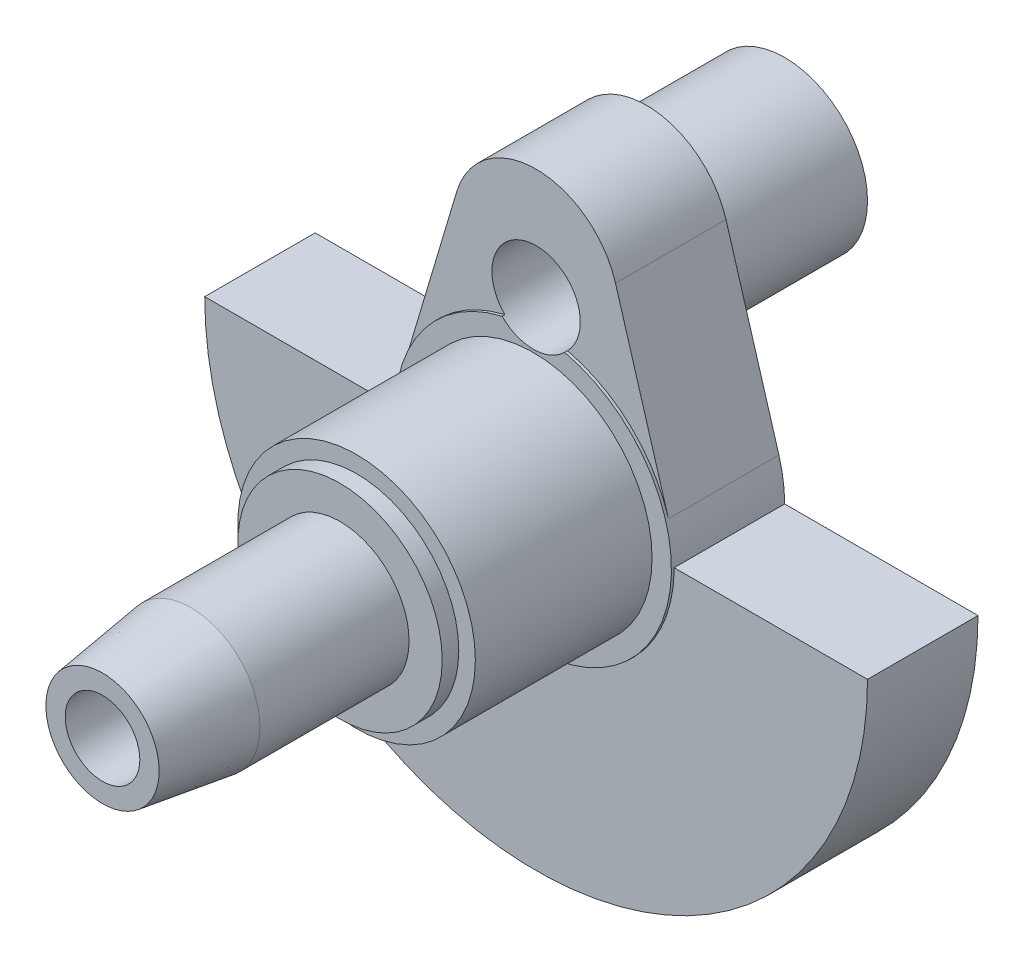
ISO-10303-21;
HEADER;
FILE_DESCRIPTION(('STEP AP214'),'2;1');
FILE_NAME('part.step','',(''),(''),'','','');
FILE_SCHEMA(('AUTOMOTIVE_DESIGN { 1 0 10303 214 1 1 1 1 }'));
ENDSEC;
DATA;
#1=APPLICATION_CONTEXT('core data for automotive mechanical design processes');
#2=APPLICATION_PROTOCOL_DEFINITION('international standard','automotive_design',2000,#1);
#3=PRODUCT_CONTEXT('',#1,'mechanical');
#4=PRODUCT('Part','Part','',(#3));
#5=PRODUCT_RELATED_PRODUCT_CATEGORY('part','',(#4));
#6=PRODUCT_DEFINITION_FORMATION('','',#4);
#7=PRODUCT_DEFINITION_CONTEXT('part definition',#1,'design');
#8=PRODUCT_DEFINITION('design','',#6,#7);
#9=PRODUCT_DEFINITION_SHAPE('','',#8);
#10=(LENGTH_UNIT() NAMED_UNIT(*) SI_UNIT(.MILLI.,.METRE.));
#11=(NAMED_UNIT(*) PLANE_ANGLE_UNIT() SI_UNIT($,.RADIAN.));
#12=(NAMED_UNIT(*) SI_UNIT($,.STERADIAN.) SOLID_ANGLE_UNIT());
#13=UNCERTAINTY_MEASURE_WITH_UNIT(LENGTH_MEASURE(1.E-05),#10,'distance_accuracy_value','');
#14=(GEOMETRIC_REPRESENTATION_CONTEXT(3) GLOBAL_UNCERTAINTY_ASSIGNED_CONTEXT((#13)) GLOBAL_UNIT_ASSIGNED_CONTEXT((#10,
#11,#12)) REPRESENTATION_CONTEXT('',''));
#15=CARTESIAN_POINT('',(0.,0.,0.));
#16=DIRECTION('',(0.,0.,1.));
#17=DIRECTION('',(1.,0.,0.));
#18=AXIS2_PLACEMENT_3D('',#15,#16,#17);
#19=CARTESIAN_POINT('',(0.,0.,-40.));
#20=DIRECTION('',(0.,0.,1.));
#21=DIRECTION('',(1.,0.,0.));
#22=AXIS2_PLACEMENT_3D('',#19,#20,#21);
#23=PLANE('',#22);
#24=CARTESIAN_POINT('',(0.,0.,-40.));
#25=DIRECTION('',(0.,0.,1.));
#26=DIRECTION('',(1.,0.,0.));
#27=AXIS2_PLACEMENT_3D('',#24,#25,#26);
#28=CIRCLE('',#27,50.);
#29=CARTESIAN_POINT('',(50.,0.,-40.));
#30=VERTEX_POINT('',#29);
#31=CARTESIAN_POINT('',(47.9157423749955,14.2857142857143,-40.));
#32=VERTEX_POINT('',#31);
#33=EDGE_CURVE('E129',#30,#32,#28,.T.);
#34=ORIENTED_EDGE('',*,*,#33,.F.);
#35=DIRECTION('',(1.,0.,0.));
#36=VECTOR('',#35,1.);
#37=CARTESIAN_POINT('',(0.,0.,-40.));
#38=LINE('',#37,#36);
#39=CARTESIAN_POINT('',(120.,0.,-40.));
#40=VERTEX_POINT('',#39);
#41=EDGE_CURVE('E127',#30,#40,#38,.T.);
#42=ORIENTED_EDGE('',*,*,#41,.T.);
#43=CARTESIAN_POINT('',(0.,0.,-40.));
#44=DIRECTION('',(0.,0.,1.));
#45=DIRECTION('',(1.,0.,0.));
#46=AXIS2_PLACEMENT_3D('',#43,#44,#45);
#47=CIRCLE('',#46,120.);
#48=CARTESIAN_POINT('',(-120.,0.,-40.));
#49=VERTEX_POINT('',#48);
#50=EDGE_CURVE('E131',#49,#40,#47,.T.);
#51=ORIENTED_EDGE('',*,*,#50,.F.);
#52=DIRECTION('',(-1.,0.,0.));
#53=VECTOR('',#52,1.);
#54=CARTESIAN_POINT('',(0.,0.,-40.));
#55=LINE('',#54,#53);
#56=CARTESIAN_POINT('',(-50.,0.,-40.));
#57=VERTEX_POINT('',#56);
#58=EDGE_CURVE('E305',#57,#49,#55,.T.);
#59=ORIENTED_EDGE('',*,*,#58,.F.);
#60=CARTESIAN_POINT('',(-47.9157423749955,14.2857142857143,-40.));
#61=VERTEX_POINT('',#60);
#62=EDGE_CURVE('E126',#61,#57,#28,.T.);
#63=ORIENTED_EDGE('',*,*,#62,.F.);
#64=DIRECTION('',(0.285714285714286,0.95831484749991,0.));
#65=VECTOR('',#64,1.);
#66=CARTESIAN_POINT('',(-47.9157423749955,14.2857142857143,-40.));
#67=LINE('',#66,#65);
#68=CARTESIAN_POINT('',(-28.7494454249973,78.5714285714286,-40.));
#69=VERTEX_POINT('',#68);
#70=EDGE_CURVE('E286',#61,#69,#67,.T.);
#71=ORIENTED_EDGE('',*,*,#70,.T.);
#72=CARTESIAN_POINT('',(0.,70.,-40.));
#73=DIRECTION('',(0.,0.,1.));
#74=DIRECTION('',(1.,0.,0.));
#75=AXIS2_PLACEMENT_3D('',#72,#73,#74);
#76=CIRCLE('',#75,30.);
#77=CARTESIAN_POINT('',(28.7494454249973,78.5714285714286,-40.));
#78=VERTEX_POINT('',#77);
#79=EDGE_CURVE('E282',#78,#69,#76,.T.);
#80=ORIENTED_EDGE('',*,*,#79,.F.);
#81=DIRECTION('',(-0.285714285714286,0.95831484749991,0.));
#82=VECTOR('',#81,1.);
#83=CARTESIAN_POINT('',(47.9157423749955,14.2857142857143,-40.));
#84=LINE('',#83,#82);
#85=EDGE_CURVE('E279',#32,#78,#84,.T.);
#86=ORIENTED_EDGE('',*,*,#85,.F.);
#87=EDGE_LOOP('',(#34,#42,#51,#59,#63,#71,#80,#86));
#88=FACE_BOUND('',#87,.T.);
#89=CARTESIAN_POINT('',(0.,60.,-40.));
#90=DIRECTION('',(0.,0.,1.));
#91=DIRECTION('',(1.,0.,0.));
#92=AXIS2_PLACEMENT_3D('',#89,#90,#91);
#93=CIRCLE('',#92,30.);
#94=CARTESIAN_POINT('',(30.,60.,-40.));
#95=VERTEX_POINT('',#94);
#96=EDGE_CURVE('E42',#95,#95,#93,.F.);
#97=ORIENTED_EDGE('',*,*,#96,.F.);
#98=EDGE_LOOP('',(#97));
#99=FACE_BOUND('',#98,.T.);
#100=ADVANCED_FACE('F34',(#88,#99),#23,.F.);
#101=CARTESIAN_POINT('',(0.,0.,1.));
#102=DIRECTION('',(0.,0.,1.));
#103=DIRECTION('',(1.,0.,0.));
#104=AXIS2_PLACEMENT_3D('',#101,#102,#103);
#105=PLANE('',#104);
#106=CARTESIAN_POINT('',(0.,60.,1.));
#107=DIRECTION('',(0.,0.,1.));
#108=DIRECTION('',(1.,0.,0.));
#109=AXIS2_PLACEMENT_3D('',#106,#107,#108);
#110=CIRCLE('',#109,16.);
#111=CARTESIAN_POINT('',(11.3274004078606,48.7,1.));
#112=VERTEX_POINT('',#111);
#113=CARTESIAN_POINT('',(-11.3274004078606,48.7,1.));
#114=VERTEX_POINT('',#113);
#115=EDGE_CURVE('E109',#112,#114,#110,.F.);
#116=ORIENTED_EDGE('',*,*,#115,.T.);
#117=CARTESIAN_POINT('',(0.,0.,1.));
#118=DIRECTION('',(0.,0.,1.));
#119=DIRECTION('',(1.,0.,0.));
#120=AXIS2_PLACEMENT_3D('',#117,#118,#119);
#121=CIRCLE('',#120,50.);
#122=EDGE_CURVE('E120',#114,#112,#121,.T.);
#123=ORIENTED_EDGE('',*,*,#122,.T.);
#124=EDGE_LOOP('',(#116,#123));
#125=FACE_BOUND('',#124,.T.);
#126=CARTESIAN_POINT('',(0.,0.,1.00000000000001));
#127=DIRECTION('',(0.,0.,1.));
#128=DIRECTION('',(1.,0.,0.));
#129=AXIS2_PLACEMENT_3D('',#126,#127,#128);
#130=CIRCLE('',#129,43.);
#131=CARTESIAN_POINT('',(43.,0.,1.00000000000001));
#132=VERTEX_POINT('',#131);
#133=EDGE_CURVE('E275',#132,#132,#130,.T.);
#134=ORIENTED_EDGE('',*,*,#133,.F.);
#135=EDGE_LOOP('',(#134));
#136=FACE_BOUND('',#135,.T.);
#137=ADVANCED_FACE('F124',(#125,#136),#105,.T.);
#138=CARTESIAN_POINT('',(0.,0.,-40.));
#139=DIRECTION('',(0.,0.,1.));
#140=DIRECTION('',(1.,0.,0.));
#141=AXIS2_PLACEMENT_3D('',#138,#139,#140);
#142=CYLINDRICAL_SURFACE('',#141,50.);
#143=DIRECTION('',(0.,0.,-1.));
#144=VECTOR('',#143,1.);
#145=CARTESIAN_POINT('',(-11.3274004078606,48.7,-19.5));
#146=LINE('',#145,#144);
#147=CARTESIAN_POINT('',(-11.3274004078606,48.7,0.));
#148=VERTEX_POINT('',#147);
#149=EDGE_CURVE('E113',#148,#114,#146,.F.);
#150=ORIENTED_EDGE('',*,*,#149,.F.);
#151=CARTESIAN_POINT('',(0.,0.,0.));
#152=DIRECTION('',(0.,0.,1.));
#153=DIRECTION('',(1.,0.,0.));
#154=AXIS2_PLACEMENT_3D('',#151,#152,#153);
#155=CIRCLE('',#154,50.);
#156=CARTESIAN_POINT('',(-47.9157423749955,14.2857142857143,0.));
#157=VERTEX_POINT('',#156);
#158=EDGE_CURVE('E292',#148,#157,#155,.T.);
#159=ORIENTED_EDGE('',*,*,#158,.T.);
#160=DIRECTION('',(0.,0.,1.));
#161=VECTOR('',#160,1.);
#162=CARTESIAN_POINT('',(-47.9157423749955,14.2857142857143,-308.328157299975));
#163=LINE('',#162,#161);
#164=EDGE_CURVE('E299',#61,#157,#163,.T.);
#165=ORIENTED_EDGE('',*,*,#164,.F.);
#166=ORIENTED_EDGE('',*,*,#62,.T.);
#167=DIRECTION('',(0.,0.,1.));
#168=VECTOR('',#167,1.);
#169=CARTESIAN_POINT('',(-50.,0.,-308.328157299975));
#170=LINE('',#169,#168);
#171=CARTESIAN_POINT('',(-50.,0.,0.));
#172=VERTEX_POINT('',#171);
#173=EDGE_CURVE('E323',#57,#172,#170,.T.);
#174=ORIENTED_EDGE('',*,*,#173,.T.);
#175=CARTESIAN_POINT('',(0.,0.,0.));
#176=DIRECTION('',(0.,0.,1.));
#177=DIRECTION('',(1.,0.,0.));
#178=AXIS2_PLACEMENT_3D('',#175,#176,#177);
#179=CIRCLE('',#178,50.);
#180=CARTESIAN_POINT('',(50.,0.,0.));
#181=VERTEX_POINT('',#180);
#182=EDGE_CURVE('E316',#172,#181,#179,.T.);
#183=ORIENTED_EDGE('',*,*,#182,.T.);
#184=DIRECTION('',(0.,0.,1.));
#185=VECTOR('',#184,1.);
#186=CARTESIAN_POINT('',(50.,0.,-308.328157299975));
#187=LINE('',#186,#185);
#188=EDGE_CURVE('E325',#30,#181,#187,.T.);
#189=ORIENTED_EDGE('',*,*,#188,.F.);
#190=ORIENTED_EDGE('',*,*,#33,.T.);
#191=DIRECTION('',(0.,0.,1.));
#192=VECTOR('',#191,1.);
#193=CARTESIAN_POINT('',(47.9157423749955,14.2857142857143,-308.328157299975));
#194=LINE('',#193,#192);
#195=CARTESIAN_POINT('',(47.9157423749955,14.2857142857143,0.));
#196=VERTEX_POINT('',#195);
#197=EDGE_CURVE('E56',#32,#196,#194,.T.);
#198=ORIENTED_EDGE('',*,*,#197,.T.);
#199=CARTESIAN_POINT('',(11.3274004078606,48.7,0.));
#200=VERTEX_POINT('',#199);
#201=EDGE_CURVE('E122',#196,#200,#155,.T.);
#202=ORIENTED_EDGE('',*,*,#201,.T.);
#203=DIRECTION('',(0.,0.,-1.));
#204=VECTOR('',#203,1.);
#205=CARTESIAN_POINT('',(11.3274004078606,48.7,-19.5));
#206=LINE('',#205,#204);
#207=EDGE_CURVE('E48',#112,#200,#206,.T.);
#208=ORIENTED_EDGE('',*,*,#207,.F.);
#209=ORIENTED_EDGE('',*,*,#122,.F.);
#210=EDGE_LOOP('',(#150,#159,#165,#166,#174,#183,#189,#190,#198,#202,#208,#209));
#211=FACE_BOUND('',#210,.T.);
#212=ADVANCED_FACE('F36',(#211),#142,.T.);
#213=CARTESIAN_POINT('',(0.,0.,-308.328157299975));
#214=DIRECTION('',(0.,0.,1.));
#215=DIRECTION('',(1.,0.,0.));
#216=AXIS2_PLACEMENT_3D('',#213,#214,#215);
#217=CYLINDRICAL_SURFACE('',#216,120.);
#218=DIRECTION('',(0.,0.,1.));
#219=VECTOR('',#218,1.);
#220=CARTESIAN_POINT('',(-120.,0.,-308.328157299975));
#221=LINE('',#220,#219);
#222=CARTESIAN_POINT('',(-120.,0.,0.));
#223=VERTEX_POINT('',#222);
#224=EDGE_CURVE('E308',#49,#223,#221,.T.);
#225=ORIENTED_EDGE('',*,*,#224,.F.);
#226=ORIENTED_EDGE('',*,*,#50,.T.);
#227=DIRECTION('',(0.,0.,1.));
#228=VECTOR('',#227,1.);
#229=CARTESIAN_POINT('',(120.,0.,-308.328157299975));
#230=LINE('',#229,#228);
#231=CARTESIAN_POINT('',(120.,0.,0.));
#232=VERTEX_POINT('',#231);
#233=EDGE_CURVE('E321',#40,#232,#230,.T.);
#234=ORIENTED_EDGE('',*,*,#233,.T.);
#235=CARTESIAN_POINT('',(0.,0.,0.));
#236=DIRECTION('',(0.,0.,1.));
#237=DIRECTION('',(1.,0.,0.));
#238=AXIS2_PLACEMENT_3D('',#235,#236,#237);
#239=CIRCLE('',#238,120.);
#240=EDGE_CURVE('E304',#232,#223,#239,.F.);
#241=ORIENTED_EDGE('',*,*,#240,.T.);
#242=EDGE_LOOP('',(#225,#226,#234,#241));
#243=FACE_BOUND('',#242,.T.);
#244=ADVANCED_FACE('F164',(#243),#217,.T.);
#245=CARTESIAN_POINT('',(0.,0.,-308.328157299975));
#246=DIRECTION('',(0.,-1.,0.));
#247=DIRECTION('',(0.,0.,-1.));
#248=AXIS2_PLACEMENT_3D('',#245,#246,#247);
#249=PLANE('',#248);
#250=ORIENTED_EDGE('',*,*,#173,.F.);
#251=ORIENTED_EDGE('',*,*,#58,.T.);
#252=ORIENTED_EDGE('',*,*,#224,.T.);
#253=DIRECTION('',(1.,0.,0.));
#254=VECTOR('',#253,1.);
#255=CARTESIAN_POINT('',(0.,0.,0.));
#256=LINE('',#255,#254);
#257=EDGE_CURVE('E318',#223,#172,#256,.T.);
#258=ORIENTED_EDGE('',*,*,#257,.T.);
#259=EDGE_LOOP('',(#250,#251,#252,#258));
#260=FACE_BOUND('',#259,.T.);
#261=ADVANCED_FACE('F167',(#260),#249,.F.);
#262=CARTESIAN_POINT('',(0.,0.,-308.328157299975));
#263=DIRECTION('',(0.,1.,0.));
#264=DIRECTION('',(0.,0.,1.));
#265=AXIS2_PLACEMENT_3D('',#262,#263,#264);
#266=PLANE('',#265);
#267=ORIENTED_EDGE('',*,*,#41,.F.);
#268=ORIENTED_EDGE('',*,*,#188,.T.);
#269=DIRECTION('',(-1.,0.,0.));
#270=VECTOR('',#269,1.);
#271=CARTESIAN_POINT('',(0.,0.,0.));
#272=LINE('',#271,#270);
#273=EDGE_CURVE('E313',#232,#181,#272,.T.);
#274=ORIENTED_EDGE('',*,*,#273,.F.);
#275=ORIENTED_EDGE('',*,*,#233,.F.);
#276=EDGE_LOOP('',(#267,#268,#274,#275));
#277=FACE_BOUND('',#276,.T.);
#278=ADVANCED_FACE('F169',(#277),#266,.T.);
#279=CARTESIAN_POINT('',(0.,0.,0.));
#280=DIRECTION('',(0.,0.,1.));
#281=DIRECTION('',(1.,0.,0.));
#282=AXIS2_PLACEMENT_3D('',#279,#280,#281);
#283=PLANE('',#282);
#284=ORIENTED_EDGE('',*,*,#240,.F.);
#285=ORIENTED_EDGE('',*,*,#273,.T.);
#286=ORIENTED_EDGE('',*,*,#182,.F.);
#287=ORIENTED_EDGE('',*,*,#257,.F.);
#288=EDGE_LOOP('',(#284,#285,#286,#287));
#289=FACE_BOUND('',#288,.T.);
#290=ADVANCED_FACE('F172',(#289),#283,.T.);
#291=CARTESIAN_POINT('',(0.,70.,-308.328157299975));
#292=DIRECTION('',(0.,0.,1.));
#293=DIRECTION('',(1.,0.,0.));
#294=AXIS2_PLACEMENT_3D('',#291,#292,#293);
#295=CYLINDRICAL_SURFACE('',#294,30.);
#296=DIRECTION('',(0.,0.,1.));
#297=VECTOR('',#296,1.);
#298=CARTESIAN_POINT('',(28.7494454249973,78.5714285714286,-308.328157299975));
#299=LINE('',#298,#297);
#300=CARTESIAN_POINT('',(28.7494454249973,78.5714285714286,0.));
#301=VERTEX_POINT('',#300);
#302=EDGE_CURVE('E283',#78,#301,#299,.T.);
#303=ORIENTED_EDGE('',*,*,#302,.F.);
#304=ORIENTED_EDGE('',*,*,#79,.T.);
#305=DIRECTION('',(0.,0.,1.));
#306=VECTOR('',#305,1.);
#307=CARTESIAN_POINT('',(-28.7494454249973,78.5714285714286,-308.328157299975));
#308=LINE('',#307,#306);
#309=CARTESIAN_POINT('',(-28.7494454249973,78.5714285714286,0.));
#310=VERTEX_POINT('',#309);
#311=EDGE_CURVE('E296',#69,#310,#308,.T.);
#312=ORIENTED_EDGE('',*,*,#311,.T.);
#313=CARTESIAN_POINT('',(0.,70.,0.));
#314=DIRECTION('',(0.,0.,1.));
#315=DIRECTION('',(1.,0.,0.));
#316=AXIS2_PLACEMENT_3D('',#313,#314,#315);
#317=CIRCLE('',#316,30.);
#318=EDGE_CURVE('E278',#310,#301,#317,.F.);
#319=ORIENTED_EDGE('',*,*,#318,.T.);
#320=EDGE_LOOP('',(#303,#304,#312,#319));
#321=FACE_BOUND('',#320,.T.);
#322=ADVANCED_FACE('F179',(#321),#295,.T.);
#323=CARTESIAN_POINT('',(47.9157423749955,14.2857142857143,-308.328157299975));
#324=DIRECTION('',(-0.95831484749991,-0.285714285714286,0.));
#325=DIRECTION('',(0.285714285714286,-0.95831484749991,0.));
#326=AXIS2_PLACEMENT_3D('',#323,#324,#325);
#327=PLANE('',#326);
#328=ORIENTED_EDGE('',*,*,#197,.F.);
#329=ORIENTED_EDGE('',*,*,#85,.T.);
#330=ORIENTED_EDGE('',*,*,#302,.T.);
#331=DIRECTION('',(0.285714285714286,-0.95831484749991,0.));
#332=VECTOR('',#331,1.);
#333=CARTESIAN_POINT('',(47.9157423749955,14.2857142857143,0.));
#334=LINE('',#333,#332);
#335=EDGE_CURVE('E294',#301,#196,#334,.T.);
#336=ORIENTED_EDGE('',*,*,#335,.T.);
#337=EDGE_LOOP('',(#328,#329,#330,#336));
#338=FACE_BOUND('',#337,.T.);
#339=ADVANCED_FACE('F183',(#338),#327,.F.);
#340=CARTESIAN_POINT('',(-47.9157423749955,14.2857142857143,-308.328157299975));
#341=DIRECTION('',(-0.95831484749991,0.285714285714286,0.));
#342=DIRECTION('',(-0.285714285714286,-0.95831484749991,0.));
#343=AXIS2_PLACEMENT_3D('',#340,#341,#342);
#344=PLANE('',#343);
#345=ORIENTED_EDGE('',*,*,#70,.F.);
#346=ORIENTED_EDGE('',*,*,#164,.T.);
#347=DIRECTION('',(-0.285714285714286,-0.95831484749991,0.));
#348=VECTOR('',#347,1.);
#349=CARTESIAN_POINT('',(-47.9157423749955,14.2857142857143,0.));
#350=LINE('',#349,#348);
#351=EDGE_CURVE('E289',#310,#157,#350,.T.);
#352=ORIENTED_EDGE('',*,*,#351,.F.);
#353=ORIENTED_EDGE('',*,*,#311,.F.);
#354=EDGE_LOOP('',(#345,#346,#352,#353));
#355=FACE_BOUND('',#354,.T.);
#356=ADVANCED_FACE('F185',(#355),#344,.T.);
#357=CARTESIAN_POINT('',(0.,0.,0.));
#358=DIRECTION('',(0.,0.,1.));
#359=DIRECTION('',(1.,0.,0.));
#360=AXIS2_PLACEMENT_3D('',#357,#358,#359);
#361=PLANE('',#360);
#362=CARTESIAN_POINT('',(0.,60.,0.));
#363=DIRECTION('',(0.,0.,1.));
#364=DIRECTION('',(1.,0.,0.));
#365=AXIS2_PLACEMENT_3D('',#362,#363,#364);
#366=CIRCLE('',#365,16.);
#367=EDGE_CURVE('E11',#200,#148,#366,.T.);
#368=ORIENTED_EDGE('',*,*,#367,.F.);
#369=ORIENTED_EDGE('',*,*,#201,.F.);
#370=ORIENTED_EDGE('',*,*,#335,.F.);
#371=ORIENTED_EDGE('',*,*,#318,.F.);
#372=ORIENTED_EDGE('',*,*,#351,.T.);
#373=ORIENTED_EDGE('',*,*,#158,.F.);
#374=EDGE_LOOP('',(#368,#369,#370,#371,#372,#373));
#375=FACE_BOUND('',#374,.T.);
#376=ADVANCED_FACE('F188',(#375),#361,.T.);
#377=CARTESIAN_POINT('',(0.,0.,125.));
#378=DIRECTION('',(0.,0.,1.));
#379=DIRECTION('',(1.,0.,0.));
#380=AXIS2_PLACEMENT_3D('',#377,#378,#379);
#381=CYLINDRICAL_SURFACE('',#380,43.);
#382=CARTESIAN_POINT('',(0.,0.,65.));
#383=DIRECTION('',(0.,0.,1.));
#384=DIRECTION('',(1.,0.,0.));
#385=AXIS2_PLACEMENT_3D('',#382,#383,#384);
#386=CIRCLE('',#385,43.);
#387=CARTESIAN_POINT('',(43.,0.,65.));
#388=VERTEX_POINT('',#387);
#389=EDGE_CURVE('E272',#388,#388,#386,.T.);
#390=ORIENTED_EDGE('',*,*,#389,.F.);
#391=EDGE_LOOP('',(#390));
#392=FACE_BOUND('',#391,.T.);
#393=ORIENTED_EDGE('',*,*,#133,.T.);
#394=EDGE_LOOP('',(#393));
#395=FACE_BOUND('',#394,.T.);
#396=ADVANCED_FACE('F195',(#392,#395),#381,.T.);
#397=CARTESIAN_POINT('',(0.,43.,65.));
#398=DIRECTION('',(0.,0.,-1.));
#399=DIRECTION('',(-1.,0.,0.));
#400=AXIS2_PLACEMENT_3D('',#397,#398,#399);
#401=PLANE('',#400);
#402=CARTESIAN_POINT('',(0.,0.,65.));
#403=DIRECTION('',(0.,0.,1.));
#404=DIRECTION('',(1.,0.,0.));
#405=AXIS2_PLACEMENT_3D('',#402,#403,#404);
#406=CIRCLE('',#405,37.);
#407=CARTESIAN_POINT('',(37.,0.,65.));
#408=VERTEX_POINT('',#407);
#409=EDGE_CURVE('E269',#408,#408,#406,.T.);
#410=ORIENTED_EDGE('',*,*,#409,.F.);
#411=EDGE_LOOP('',(#410));
#412=FACE_BOUND('',#411,.T.);
#413=ORIENTED_EDGE('',*,*,#389,.T.);
#414=EDGE_LOOP('',(#413));
#415=FACE_BOUND('',#414,.T.);
#416=ADVANCED_FACE('F199',(#412,#415),#401,.F.);
#417=CARTESIAN_POINT('',(0.,0.,125.));
#418=DIRECTION('',(0.,0.,1.));
#419=DIRECTION('',(1.,0.,0.));
#420=AXIS2_PLACEMENT_3D('',#417,#418,#419);
#421=CYLINDRICAL_SURFACE('',#420,37.);
#422=CARTESIAN_POINT('',(0.,0.,71.));
#423=DIRECTION('',(0.,0.,1.));
#424=DIRECTION('',(1.,0.,0.));
#425=AXIS2_PLACEMENT_3D('',#422,#423,#424);
#426=CIRCLE('',#425,37.);
#427=CARTESIAN_POINT('',(37.,0.,71.));
#428=VERTEX_POINT('',#427);
#429=EDGE_CURVE('E266',#428,#428,#426,.T.);
#430=ORIENTED_EDGE('',*,*,#429,.F.);
#431=EDGE_LOOP('',(#430));
#432=FACE_BOUND('',#431,.T.);
#433=ORIENTED_EDGE('',*,*,#409,.T.);
#434=EDGE_LOOP('',(#433));
#435=FACE_BOUND('',#434,.T.);
#436=ADVANCED_FACE('F203',(#432,#435),#421,.T.);
#437=CARTESIAN_POINT('',(0.,37.,71.));
#438=DIRECTION('',(0.,0.,-1.));
#439=DIRECTION('',(-1.,0.,0.));
#440=AXIS2_PLACEMENT_3D('',#437,#438,#439);
#441=PLANE('',#440);
#442=CARTESIAN_POINT('',(0.,0.,71.));
#443=DIRECTION('',(0.,0.,1.));
#444=DIRECTION('',(1.,0.,0.));
#445=AXIS2_PLACEMENT_3D('',#442,#443,#444);
#446=CIRCLE('',#445,25.);
#447=CARTESIAN_POINT('',(25.,0.,71.));
#448=VERTEX_POINT('',#447);
#449=EDGE_CURVE('E263',#448,#448,#446,.T.);
#450=ORIENTED_EDGE('',*,*,#449,.F.);
#451=EDGE_LOOP('',(#450));
#452=FACE_BOUND('',#451,.T.);
#453=ORIENTED_EDGE('',*,*,#429,.T.);
#454=EDGE_LOOP('',(#453));
#455=FACE_BOUND('',#454,.T.);
#456=ADVANCED_FACE('F207',(#452,#455),#441,.F.);
#457=CARTESIAN_POINT('',(0.,0.,125.));
#458=DIRECTION('',(0.,0.,1.));
#459=DIRECTION('',(1.,0.,0.));
#460=AXIS2_PLACEMENT_3D('',#457,#458,#459);
#461=CYLINDRICAL_SURFACE('',#460,25.);
#462=CARTESIAN_POINT('',(0.,0.,125.));
#463=DIRECTION('',(0.,0.,1.));
#464=DIRECTION('',(1.,0.,0.));
#465=AXIS2_PLACEMENT_3D('',#462,#463,#464);
#466=CIRCLE('',#465,25.);
#467=CARTESIAN_POINT('',(25.,0.,125.));
#468=VERTEX_POINT('',#467);
#469=EDGE_CURVE('E260',#468,#468,#466,.T.);
#470=ORIENTED_EDGE('',*,*,#469,.F.);
#471=EDGE_LOOP('',(#470));
#472=FACE_BOUND('',#471,.T.);
#473=ORIENTED_EDGE('',*,*,#449,.T.);
#474=EDGE_LOOP('',(#473));
#475=FACE_BOUND('',#474,.T.);
#476=ADVANCED_FACE('F211',(#472,#475),#461,.T.);
#477=CARTESIAN_POINT('',(0.,0.,125.));
#478=DIRECTION('',(0.,0.,-1.));
#479=DIRECTION('',(1.,0.,0.));
#480=AXIS2_PLACEMENT_3D('',#477,#478,#479);
#481=CONICAL_SURFACE('',#480,25.,0.139626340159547);
#482=CARTESIAN_POINT('',(0.,0.,157.));
#483=DIRECTION('',(0.,0.,1.));
#484=DIRECTION('',(1.,0.,0.));
#485=AXIS2_PLACEMENT_3D('',#482,#483,#484);
#486=CIRCLE('',#485,20.5026932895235);
#487=CARTESIAN_POINT('',(20.5026932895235,0.,157.));
#488=VERTEX_POINT('',#487);
#489=EDGE_CURVE('E251',#488,#488,#486,.T.);
#490=ORIENTED_EDGE('',*,*,#489,.F.);
#491=EDGE_LOOP('',(#490));
#492=FACE_BOUND('',#491,.T.);
#493=ORIENTED_EDGE('',*,*,#469,.T.);
#494=EDGE_LOOP('',(#493));
#495=FACE_BOUND('',#494,.T.);
#496=ADVANCED_FACE('F215',(#492,#495),#481,.T.);
#497=CARTESIAN_POINT('',(0.,0.,157.));
#498=DIRECTION('',(0.,0.,1.));
#499=DIRECTION('',(1.,0.,0.));
#500=AXIS2_PLACEMENT_3D('',#497,#498,#499);
#501=PLANE('',#500);
#502=CARTESIAN_POINT('',(0.,0.,157.));
#503=DIRECTION('',(0.,0.,1.));
#504=DIRECTION('',(1.,0.,0.));
#505=AXIS2_PLACEMENT_3D('',#502,#503,#504);
#506=CIRCLE('',#505,13.5026932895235);
#507=CARTESIAN_POINT('',(13.5026932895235,0.,157.));
#508=VERTEX_POINT('',#507);
#509=EDGE_CURVE('E347',#508,#508,#506,.T.);
#510=ORIENTED_EDGE('',*,*,#509,.F.);
#511=EDGE_LOOP('',(#510));
#512=FACE_BOUND('',#511,.T.);
#513=ORIENTED_EDGE('',*,*,#489,.T.);
#514=EDGE_LOOP('',(#513));
#515=FACE_BOUND('',#514,.T.);
#516=ADVANCED_FACE('F219',(#512,#515),#501,.T.);
#517=CARTESIAN_POINT('',(0.,60.,-90.));
#518=DIRECTION('',(0.,0.,1.));
#519=DIRECTION('',(1.,0.,0.));
#520=AXIS2_PLACEMENT_3D('',#517,#518,#519);
#521=CYLINDRICAL_SURFACE('',#520,30.);
#522=CARTESIAN_POINT('',(0.,60.,-90.));
#523=DIRECTION('',(0.,0.,-1.));
#524=DIRECTION('',(-1.,0.,0.));
#525=AXIS2_PLACEMENT_3D('',#522,#523,#524);
#526=CIRCLE('',#525,30.);
#527=CARTESIAN_POINT('',(-30.,60.,-90.));
#528=VERTEX_POINT('',#527);
#529=EDGE_CURVE('E247',#528,#528,#526,.T.);
#530=ORIENTED_EDGE('',*,*,#529,.F.);
#531=EDGE_LOOP('',(#530));
#532=FACE_BOUND('',#531,.T.);
#533=ORIENTED_EDGE('',*,*,#96,.T.);
#534=EDGE_LOOP('',(#533));
#535=FACE_BOUND('',#534,.T.);
#536=ADVANCED_FACE('F223',(#532,#535),#521,.T.);
#537=CARTESIAN_POINT('',(0.,60.,-90.));
#538=DIRECTION('',(0.,0.,-1.));
#539=DIRECTION('',(-1.,0.,0.));
#540=AXIS2_PLACEMENT_3D('',#537,#538,#539);
#541=PLANE('',#540);
#542=CARTESIAN_POINT('',(0.,60.,-90.));
#543=DIRECTION('',(0.,0.,-1.));
#544=DIRECTION('',(-1.,0.,0.));
#545=AXIS2_PLACEMENT_3D('',#542,#543,#544);
#546=CIRCLE('',#545,21.);
#547=CARTESIAN_POINT('',(-21.,60.,-90.));
#548=VERTEX_POINT('',#547);
#549=EDGE_CURVE('E248',#548,#548,#546,.T.);
#550=ORIENTED_EDGE('',*,*,#549,.F.);
#551=EDGE_LOOP('',(#550));
#552=FACE_BOUND('',#551,.T.);
#553=ORIENTED_EDGE('',*,*,#529,.T.);
#554=EDGE_LOOP('',(#553));
#555=FACE_BOUND('',#554,.T.);
#556=ADVANCED_FACE('F227',(#552,#555),#541,.T.);
#557=CARTESIAN_POINT('',(0.,60.,-65.));
#558=DIRECTION('',(0.,0.,-1.));
#559=DIRECTION('',(-1.,0.,0.));
#560=AXIS2_PLACEMENT_3D('',#557,#558,#559);
#561=CYLINDRICAL_SURFACE('',#560,21.);
#562=CARTESIAN_POINT('',(0.,60.,-65.));
#563=DIRECTION('',(0.,0.,-1.));
#564=DIRECTION('',(-1.,0.,0.));
#565=AXIS2_PLACEMENT_3D('',#562,#563,#564);
#566=CIRCLE('',#565,21.);
#567=CARTESIAN_POINT('',(-21.,60.,-65.));
#568=VERTEX_POINT('',#567);
#569=EDGE_CURVE('E246',#568,#568,#566,.T.);
#570=ORIENTED_EDGE('',*,*,#569,.F.);
#571=EDGE_LOOP('',(#570));
#572=FACE_BOUND('',#571,.T.);
#573=ORIENTED_EDGE('',*,*,#549,.T.);
#574=EDGE_LOOP('',(#573));
#575=FACE_BOUND('',#574,.T.);
#576=ADVANCED_FACE('F231',(#572,#575),#561,.F.);
#577=CARTESIAN_POINT('',(0.,60.,-65.));
#578=DIRECTION('',(0.,0.,-1.));
#579=DIRECTION('',(-1.,0.,0.));
#580=AXIS2_PLACEMENT_3D('',#577,#578,#579);
#581=PLANE('',#580);
#582=CARTESIAN_POINT('',(0.,60.,-65.));
#583=DIRECTION('',(0.,0.,-1.));
#584=DIRECTION('',(-1.,0.,0.));
#585=AXIS2_PLACEMENT_3D('',#582,#583,#584);
#586=CIRCLE('',#585,11.);
#587=CARTESIAN_POINT('',(-11.,60.,-65.));
#588=VERTEX_POINT('',#587);
#589=EDGE_CURVE('E243',#588,#588,#586,.T.);
#590=ORIENTED_EDGE('',*,*,#589,.F.);
#591=EDGE_LOOP('',(#590));
#592=FACE_BOUND('',#591,.T.);
#593=ORIENTED_EDGE('',*,*,#569,.T.);
#594=EDGE_LOOP('',(#593));
#595=FACE_BOUND('',#594,.T.);
#596=ADVANCED_FACE('F152',(#592,#595),#581,.T.);
#597=CARTESIAN_POINT('',(0.,60.,32.1126983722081));
#598=DIRECTION('',(0.,0.,-1.));
#599=DIRECTION('',(-1.,0.,0.));
#600=AXIS2_PLACEMENT_3D('',#597,#598,#599);
#601=CYLINDRICAL_SURFACE('',#600,11.);
#602=CARTESIAN_POINT('',(0.,60.,-40.));
#603=DIRECTION('',(0.,0.,-1.));
#604=DIRECTION('',(-1.,0.,0.));
#605=AXIS2_PLACEMENT_3D('',#602,#603,#604);
#606=CIRCLE('',#605,11.);
#607=CARTESIAN_POINT('',(-11.,60.,-40.));
#608=VERTEX_POINT('',#607);
#609=EDGE_CURVE('E117',#608,#608,#606,.F.);
#610=ORIENTED_EDGE('',*,*,#609,.T.);
#611=EDGE_LOOP('',(#610));
#612=FACE_BOUND('',#611,.T.);
#613=ORIENTED_EDGE('',*,*,#589,.T.);
#614=EDGE_LOOP('',(#613));
#615=FACE_BOUND('',#614,.T.);
#616=ADVANCED_FACE('F139',(#612,#615),#601,.F.);
#617=CARTESIAN_POINT('',(0.,60.,-40.));
#618=DIRECTION('',(0.,0.,-1.));
#619=DIRECTION('',(-1.,0.,0.));
#620=AXIS2_PLACEMENT_3D('',#617,#618,#619);
#621=PLANE('',#620);
#622=CARTESIAN_POINT('',(0.,60.,-40.));
#623=DIRECTION('',(0.,0.,-1.));
#624=DIRECTION('',(-1.,0.,0.));
#625=AXIS2_PLACEMENT_3D('',#622,#623,#624);
#626=CIRCLE('',#625,16.);
#627=CARTESIAN_POINT('',(-16.,60.,-40.));
#628=VERTEX_POINT('',#627);
#629=EDGE_CURVE('E118',#628,#628,#626,.T.);
#630=ORIENTED_EDGE('',*,*,#629,.F.);
#631=EDGE_LOOP('',(#630));
#632=FACE_BOUND('',#631,.T.);
#633=ORIENTED_EDGE('',*,*,#609,.F.);
#634=EDGE_LOOP('',(#633));
#635=FACE_BOUND('',#634,.T.);
#636=ADVANCED_FACE('F142',(#632,#635),#621,.F.);
#637=CARTESIAN_POINT('',(0.,60.,46.254833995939));
#638=DIRECTION('',(0.,0.,-1.));
#639=DIRECTION('',(-1.,0.,0.));
#640=AXIS2_PLACEMENT_3D('',#637,#638,#639);
#641=CYLINDRICAL_SURFACE('',#640,16.);
#642=ORIENTED_EDGE('',*,*,#149,.T.);
#643=ORIENTED_EDGE('',*,*,#115,.F.);
#644=ORIENTED_EDGE('',*,*,#207,.T.);
#645=ORIENTED_EDGE('',*,*,#367,.T.);
#646=EDGE_LOOP('',(#642,#643,#644,#645));
#647=FACE_BOUND('',#646,.T.);
#648=ORIENTED_EDGE('',*,*,#629,.T.);
#649=EDGE_LOOP('',(#648));
#650=FACE_BOUND('',#649,.T.);
#651=ADVANCED_FACE('F110',(#647,#650),#641,.F.);
#652=CARTESIAN_POINT('',(0.,0.,127.));
#653=DIRECTION('',(0.,0.,1.));
#654=DIRECTION('',(1.,0.,0.));
#655=AXIS2_PLACEMENT_3D('',#652,#653,#654);
#656=CYLINDRICAL_SURFACE('',#655,13.5026932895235);
#657=CARTESIAN_POINT('',(0.,0.,127.));
#658=DIRECTION('',(0.,0.,1.));
#659=DIRECTION('',(1.,0.,0.));
#660=AXIS2_PLACEMENT_3D('',#657,#658,#659);
#661=CIRCLE('',#660,13.5026932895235);
#662=CARTESIAN_POINT('',(13.5026932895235,0.,127.));
#663=VERTEX_POINT('',#662);
#664=EDGE_CURVE('E346',#663,#663,#661,.T.);
#665=ORIENTED_EDGE('',*,*,#664,.F.);
#666=EDGE_LOOP('',(#665));
#667=FACE_BOUND('',#666,.T.);
#668=ORIENTED_EDGE('',*,*,#509,.T.);
#669=EDGE_LOOP('',(#668));
#670=FACE_BOUND('',#669,.T.);
#671=ADVANCED_FACE('F150',(#667,#670),#656,.F.);
#672=CARTESIAN_POINT('',(0.,0.,127.));
#673=DIRECTION('',(0.,0.,1.));
#674=DIRECTION('',(1.,0.,0.));
#675=AXIS2_PLACEMENT_3D('',#672,#673,#674);
#676=PLANE('',#675);
#677=ORIENTED_EDGE('',*,*,#664,.T.);
#678=EDGE_LOOP('',(#677));
#679=FACE_BOUND('',#678,.T.);
#680=ADVANCED_FACE('F353',(#679),#676,.T.);
#681=CLOSED_SHELL('',(#100,#137,#212,#244,#261,#278,#290,#322,#339,#356,#376,#396,#416,#436,
#456,#476,#496,#516,#536,#556,#576,#596,#616,#636,#651,#671,#680));
#682=MANIFOLD_SOLID_BREP('B2',#681);
#683=ADVANCED_BREP_SHAPE_REPRESENTATION('',(#18,#682),#14);
#684=SHAPE_DEFINITION_REPRESENTATION(#9,#683);
ENDSEC;
END-ISO-10303-21;
